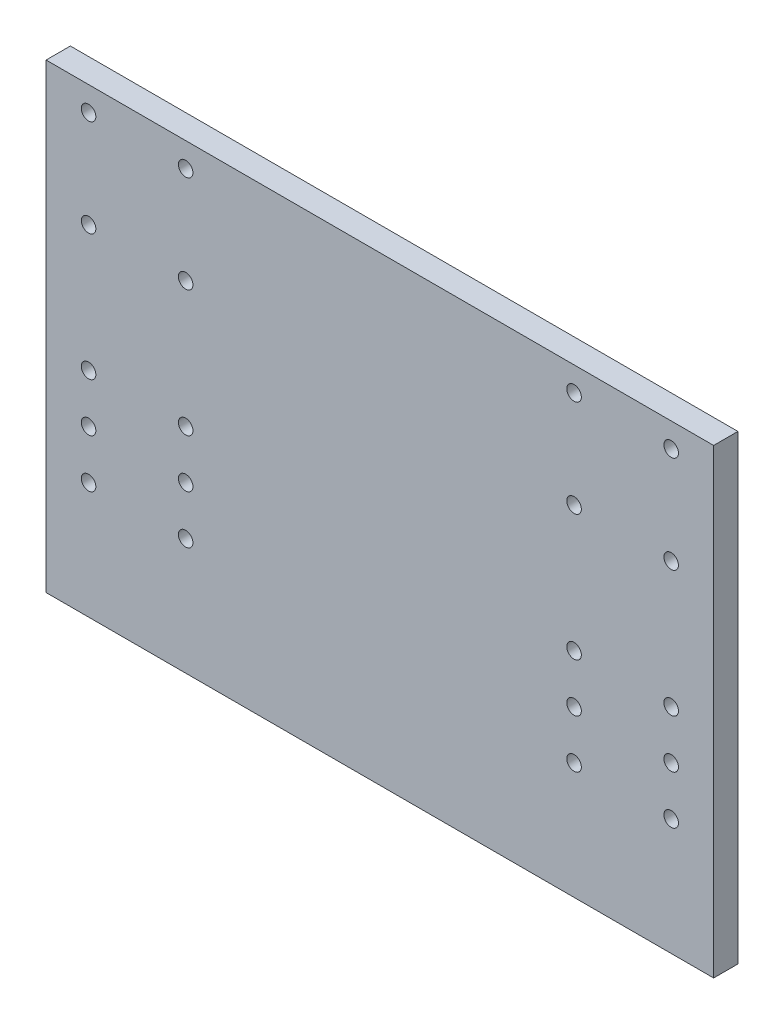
ISO-10303-21;
HEADER;
FILE_DESCRIPTION(('STEP AP214'),'2;1');
FILE_NAME('part.step','',(''),(''),'','','');
FILE_SCHEMA(('AUTOMOTIVE_DESIGN { 1 0 10303 214 1 1 1 1 }'));
ENDSEC;
DATA;
#1=APPLICATION_CONTEXT('core data for automotive mechanical design processes');
#2=APPLICATION_PROTOCOL_DEFINITION('international standard','automotive_design',2000,#1);
#3=PRODUCT_CONTEXT('',#1,'mechanical');
#4=PRODUCT('Part','Part','',(#3));
#5=PRODUCT_RELATED_PRODUCT_CATEGORY('part','',(#4));
#6=PRODUCT_DEFINITION_FORMATION('','',#4);
#7=PRODUCT_DEFINITION_CONTEXT('part definition',#1,'design');
#8=PRODUCT_DEFINITION('design','',#6,#7);
#9=PRODUCT_DEFINITION_SHAPE('','',#8);
#10=(LENGTH_UNIT() NAMED_UNIT(*) SI_UNIT(.MILLI.,.METRE.));
#11=(NAMED_UNIT(*) PLANE_ANGLE_UNIT() SI_UNIT($,.RADIAN.));
#12=(NAMED_UNIT(*) SI_UNIT($,.STERADIAN.) SOLID_ANGLE_UNIT());
#13=UNCERTAINTY_MEASURE_WITH_UNIT(LENGTH_MEASURE(1.E-05),#10,'distance_accuracy_value','');
#14=(GEOMETRIC_REPRESENTATION_CONTEXT(3) GLOBAL_UNCERTAINTY_ASSIGNED_CONTEXT((#13)) GLOBAL_UNIT_ASSIGNED_CONTEXT((#10,
#11,#12)) REPRESENTATION_CONTEXT('',''));
#15=CARTESIAN_POINT('',(0.,0.,0.));
#16=DIRECTION('',(0.,0.,1.));
#17=DIRECTION('',(1.,0.,0.));
#18=AXIS2_PLACEMENT_3D('',#15,#16,#17);
#19=CARTESIAN_POINT('',(-137.5,-95.,10.));
#20=DIRECTION('',(1.,0.,0.));
#21=DIRECTION('',(0.,0.,-1.));
#22=AXIS2_PLACEMENT_3D('',#19,#20,#21);
#23=PLANE('',#22);
#24=DIRECTION('',(0.,-1.,0.));
#25=VECTOR('',#24,1.);
#26=CARTESIAN_POINT('',(-137.5,-95.,0.));
#27=LINE('',#26,#25);
#28=CARTESIAN_POINT('',(-137.5,95.,0.));
#29=VERTEX_POINT('',#28);
#30=CARTESIAN_POINT('',(-137.5,-95.,0.));
#31=VERTEX_POINT('',#30);
#32=EDGE_CURVE('E98',#29,#31,#27,.T.);
#33=ORIENTED_EDGE('',*,*,#32,.T.);
#34=DIRECTION('',(0.,0.,-1.));
#35=VECTOR('',#34,1.);
#36=CARTESIAN_POINT('',(-137.5,-95.,10.));
#37=LINE('',#36,#35);
#38=CARTESIAN_POINT('',(-137.5,-95.,10.));
#39=VERTEX_POINT('',#38);
#40=EDGE_CURVE('E11',#39,#31,#37,.T.);
#41=ORIENTED_EDGE('',*,*,#40,.F.);
#42=DIRECTION('',(0.,-1.,0.));
#43=VECTOR('',#42,1.);
#44=CARTESIAN_POINT('',(-137.5,-95.,10.));
#45=LINE('',#44,#43);
#46=CARTESIAN_POINT('',(-137.5,95.,10.));
#47=VERTEX_POINT('',#46);
#48=EDGE_CURVE('E86',#47,#39,#45,.T.);
#49=ORIENTED_EDGE('',*,*,#48,.F.);
#50=DIRECTION('',(0.,0.,-1.));
#51=VECTOR('',#50,1.);
#52=CARTESIAN_POINT('',(-137.5,95.,10.));
#53=LINE('',#52,#51);
#54=EDGE_CURVE('E94',#47,#29,#53,.T.);
#55=ORIENTED_EDGE('',*,*,#54,.T.);
#56=EDGE_LOOP('',(#33,#41,#49,#55));
#57=FACE_BOUND('',#56,.T.);
#58=ADVANCED_FACE('F35',(#57),#23,.F.);
#59=CARTESIAN_POINT('',(137.5,-95.,10.));
#60=DIRECTION('',(0.,1.,0.));
#61=DIRECTION('',(-1.,0.,0.));
#62=AXIS2_PLACEMENT_3D('',#59,#60,#61);
#63=PLANE('',#62);
#64=DIRECTION('',(1.,0.,0.));
#65=VECTOR('',#64,1.);
#66=CARTESIAN_POINT('',(137.5,-95.,0.));
#67=LINE('',#66,#65);
#68=CARTESIAN_POINT('',(137.5,-95.,0.));
#69=VERTEX_POINT('',#68);
#70=EDGE_CURVE('E90',#31,#69,#67,.T.);
#71=ORIENTED_EDGE('',*,*,#70,.T.);
#72=DIRECTION('',(0.,0.,-1.));
#73=VECTOR('',#72,1.);
#74=CARTESIAN_POINT('',(137.5,-95.,10.));
#75=LINE('',#74,#73);
#76=CARTESIAN_POINT('',(137.5,-95.,10.));
#77=VERTEX_POINT('',#76);
#78=EDGE_CURVE('E43',#77,#69,#75,.T.);
#79=ORIENTED_EDGE('',*,*,#78,.F.);
#80=DIRECTION('',(1.,0.,0.));
#81=VECTOR('',#80,1.);
#82=CARTESIAN_POINT('',(137.5,-95.,10.));
#83=LINE('',#82,#81);
#84=EDGE_CURVE('E81',#39,#77,#83,.T.);
#85=ORIENTED_EDGE('',*,*,#84,.F.);
#86=ORIENTED_EDGE('',*,*,#40,.T.);
#87=EDGE_LOOP('',(#71,#79,#85,#86));
#88=FACE_BOUND('',#87,.T.);
#89=ADVANCED_FACE('F89',(#88),#63,.F.);
#90=CARTESIAN_POINT('',(137.5,-95.,10.));
#91=DIRECTION('',(-1.,0.,0.));
#92=DIRECTION('',(0.,0.,1.));
#93=AXIS2_PLACEMENT_3D('',#90,#91,#92);
#94=PLANE('',#93);
#95=DIRECTION('',(0.,1.,0.));
#96=VECTOR('',#95,1.);
#97=CARTESIAN_POINT('',(137.5,-95.,0.));
#98=LINE('',#97,#96);
#99=CARTESIAN_POINT('',(137.5,95.,0.));
#100=VERTEX_POINT('',#99);
#101=EDGE_CURVE('E68',#69,#100,#98,.T.);
#102=ORIENTED_EDGE('',*,*,#101,.T.);
#103=DIRECTION('',(0.,0.,-1.));
#104=VECTOR('',#103,1.);
#105=CARTESIAN_POINT('',(137.5,95.,10.));
#106=LINE('',#105,#104);
#107=CARTESIAN_POINT('',(137.5,95.,10.));
#108=VERTEX_POINT('',#107);
#109=EDGE_CURVE('E91',#108,#100,#106,.T.);
#110=ORIENTED_EDGE('',*,*,#109,.F.);
#111=DIRECTION('',(0.,1.,0.));
#112=VECTOR('',#111,1.);
#113=CARTESIAN_POINT('',(137.5,-95.,10.));
#114=LINE('',#113,#112);
#115=EDGE_CURVE('E84',#77,#108,#114,.T.);
#116=ORIENTED_EDGE('',*,*,#115,.F.);
#117=ORIENTED_EDGE('',*,*,#78,.T.);
#118=EDGE_LOOP('',(#102,#110,#116,#117));
#119=FACE_BOUND('',#118,.T.);
#120=ADVANCED_FACE('F92',(#119),#94,.F.);
#121=CARTESIAN_POINT('',(137.5,95.,10.));
#122=DIRECTION('',(0.,-1.,0.));
#123=DIRECTION('',(1.,0.,0.));
#124=AXIS2_PLACEMENT_3D('',#121,#122,#123);
#125=PLANE('',#124);
#126=DIRECTION('',(-1.,0.,0.));
#127=VECTOR('',#126,1.);
#128=CARTESIAN_POINT('',(137.5,95.,0.));
#129=LINE('',#128,#127);
#130=EDGE_CURVE('E74',#100,#29,#129,.T.);
#131=ORIENTED_EDGE('',*,*,#130,.T.);
#132=ORIENTED_EDGE('',*,*,#54,.F.);
#133=DIRECTION('',(-1.,0.,0.));
#134=VECTOR('',#133,1.);
#135=CARTESIAN_POINT('',(137.5,95.,10.));
#136=LINE('',#135,#134);
#137=EDGE_CURVE('E51',#108,#47,#136,.T.);
#138=ORIENTED_EDGE('',*,*,#137,.F.);
#139=ORIENTED_EDGE('',*,*,#109,.T.);
#140=EDGE_LOOP('',(#131,#132,#138,#139));
#141=FACE_BOUND('',#140,.T.);
#142=ADVANCED_FACE('F106',(#141),#125,.F.);
#143=CARTESIAN_POINT('',(0.,0.,10.));
#144=DIRECTION('',(0.,0.,1.));
#145=DIRECTION('',(1.,0.,0.));
#146=AXIS2_PLACEMENT_3D('',#143,#144,#145);
#147=PLANE('',#146);
#148=CARTESIAN_POINT('',(80.,45.,10.));
#149=DIRECTION('',(0.,0.,1.));
#150=DIRECTION('',(1.,0.,0.));
#151=AXIS2_PLACEMENT_3D('',#148,#149,#150);
#152=CIRCLE('',#151,3.00000000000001);
#153=CARTESIAN_POINT('',(83.,45.,10.));
#154=VERTEX_POINT('',#153);
#155=EDGE_CURVE('E197',#154,#154,#152,.T.);
#156=ORIENTED_EDGE('',*,*,#155,.F.);
#157=EDGE_LOOP('',(#156));
#158=FACE_BOUND('',#157,.T.);
#159=CARTESIAN_POINT('',(80.,85.,10.));
#160=DIRECTION('',(0.,0.,1.));
#161=DIRECTION('',(1.,0.,0.));
#162=AXIS2_PLACEMENT_3D('',#159,#160,#161);
#163=CIRCLE('',#162,3.00000000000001);
#164=CARTESIAN_POINT('',(83.,85.,10.));
#165=VERTEX_POINT('',#164);
#166=EDGE_CURVE('E191',#165,#165,#163,.T.);
#167=ORIENTED_EDGE('',*,*,#166,.F.);
#168=EDGE_LOOP('',(#167));
#169=FACE_BOUND('',#168,.T.);
#170=CARTESIAN_POINT('',(-80.,85.,10.));
#171=DIRECTION('',(0.,0.,1.));
#172=DIRECTION('',(-1.,0.,0.));
#173=AXIS2_PLACEMENT_3D('',#170,#171,#172);
#174=CIRCLE('',#173,3.00000000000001);
#175=CARTESIAN_POINT('',(-83.,85.,10.));
#176=VERTEX_POINT('',#175);
#177=EDGE_CURVE('E185',#176,#176,#174,.T.);
#178=ORIENTED_EDGE('',*,*,#177,.F.);
#179=EDGE_LOOP('',(#178));
#180=FACE_BOUND('',#179,.T.);
#181=CARTESIAN_POINT('',(-80.,45.,10.));
#182=DIRECTION('',(0.,0.,1.));
#183=DIRECTION('',(-1.,0.,0.));
#184=AXIS2_PLACEMENT_3D('',#181,#182,#183);
#185=CIRCLE('',#184,3.00000000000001);
#186=CARTESIAN_POINT('',(-83.,45.,10.));
#187=VERTEX_POINT('',#186);
#188=EDGE_CURVE('E179',#187,#187,#185,.T.);
#189=ORIENTED_EDGE('',*,*,#188,.F.);
#190=EDGE_LOOP('',(#189));
#191=FACE_BOUND('',#190,.T.);
#192=CARTESIAN_POINT('',(-120.,45.,10.));
#193=DIRECTION('',(0.,0.,1.));
#194=DIRECTION('',(-1.,0.,0.));
#195=AXIS2_PLACEMENT_3D('',#192,#193,#194);
#196=CIRCLE('',#195,3.00000000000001);
#197=CARTESIAN_POINT('',(-123.,45.,10.));
#198=VERTEX_POINT('',#197);
#199=EDGE_CURVE('E172',#198,#198,#196,.T.);
#200=ORIENTED_EDGE('',*,*,#199,.F.);
#201=EDGE_LOOP('',(#200));
#202=FACE_BOUND('',#201,.T.);
#203=CARTESIAN_POINT('',(-120.,85.,10.));
#204=DIRECTION('',(0.,0.,1.));
#205=DIRECTION('',(-1.,0.,0.));
#206=AXIS2_PLACEMENT_3D('',#203,#204,#205);
#207=CIRCLE('',#206,3.00000000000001);
#208=CARTESIAN_POINT('',(-123.,85.,10.));
#209=VERTEX_POINT('',#208);
#210=EDGE_CURVE('E226',#209,#209,#207,.T.);
#211=ORIENTED_EDGE('',*,*,#210,.F.);
#212=EDGE_LOOP('',(#211));
#213=FACE_BOUND('',#212,.T.);
#214=CARTESIAN_POINT('',(-120.,-7.00000000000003,10.));
#215=DIRECTION('',(0.,0.,1.));
#216=DIRECTION('',(1.,0.,0.));
#217=AXIS2_PLACEMENT_3D('',#214,#215,#216);
#218=CIRCLE('',#217,3.00000000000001);
#219=CARTESIAN_POINT('',(-117.,-7.00000000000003,10.));
#220=VERTEX_POINT('',#219);
#221=EDGE_CURVE('E220',#220,#220,#218,.T.);
#222=ORIENTED_EDGE('',*,*,#221,.F.);
#223=EDGE_LOOP('',(#222));
#224=FACE_BOUND('',#223,.T.);
#225=CARTESIAN_POINT('',(-80.,-7.00000000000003,10.));
#226=DIRECTION('',(0.,0.,1.));
#227=DIRECTION('',(1.,0.,0.));
#228=AXIS2_PLACEMENT_3D('',#225,#226,#227);
#229=CIRCLE('',#228,3.00000000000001);
#230=CARTESIAN_POINT('',(-77.,-7.00000000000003,10.));
#231=VERTEX_POINT('',#230);
#232=EDGE_CURVE('E214',#231,#231,#229,.T.);
#233=ORIENTED_EDGE('',*,*,#232,.F.);
#234=EDGE_LOOP('',(#233));
#235=FACE_BOUND('',#234,.T.);
#236=CARTESIAN_POINT('',(80.,-7.00000000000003,10.));
#237=DIRECTION('',(0.,0.,1.));
#238=DIRECTION('',(-1.,0.,0.));
#239=AXIS2_PLACEMENT_3D('',#236,#237,#238);
#240=CIRCLE('',#239,3.00000000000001);
#241=CARTESIAN_POINT('',(77.,-7.00000000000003,10.));
#242=VERTEX_POINT('',#241);
#243=EDGE_CURVE('E208',#242,#242,#240,.T.);
#244=ORIENTED_EDGE('',*,*,#243,.F.);
#245=EDGE_LOOP('',(#244));
#246=FACE_BOUND('',#245,.T.);
#247=CARTESIAN_POINT('',(120.,-7.00000000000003,10.));
#248=DIRECTION('',(0.,0.,1.));
#249=DIRECTION('',(-1.,0.,0.));
#250=AXIS2_PLACEMENT_3D('',#247,#248,#249);
#251=CIRCLE('',#250,3.00000000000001);
#252=CARTESIAN_POINT('',(117.,-7.00000000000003,10.));
#253=VERTEX_POINT('',#252);
#254=EDGE_CURVE('E202',#253,#253,#251,.T.);
#255=ORIENTED_EDGE('',*,*,#254,.F.);
#256=EDGE_LOOP('',(#255));
#257=FACE_BOUND('',#256,.T.);
#258=CARTESIAN_POINT('',(-120.,-27.,10.));
#259=DIRECTION('',(0.,0.,1.));
#260=DIRECTION('',(1.,0.,0.));
#261=AXIS2_PLACEMENT_3D('',#258,#259,#260);
#262=CIRCLE('',#261,3.00000000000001);
#263=CARTESIAN_POINT('',(-117.,-27.,10.));
#264=VERTEX_POINT('',#263);
#265=EDGE_CURVE('E137',#264,#264,#262,.T.);
#266=ORIENTED_EDGE('',*,*,#265,.F.);
#267=EDGE_LOOP('',(#266));
#268=FACE_BOUND('',#267,.T.);
#269=CARTESIAN_POINT('',(-80.,-27.,10.));
#270=DIRECTION('',(0.,0.,1.));
#271=DIRECTION('',(1.,0.,0.));
#272=AXIS2_PLACEMENT_3D('',#269,#270,#271);
#273=CIRCLE('',#272,3.00000000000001);
#274=CARTESIAN_POINT('',(-77.,-27.,10.));
#275=VERTEX_POINT('',#274);
#276=EDGE_CURVE('E131',#275,#275,#273,.T.);
#277=ORIENTED_EDGE('',*,*,#276,.F.);
#278=EDGE_LOOP('',(#277));
#279=FACE_BOUND('',#278,.T.);
#280=CARTESIAN_POINT('',(-80.,-47.,10.));
#281=DIRECTION('',(0.,0.,1.));
#282=DIRECTION('',(1.,0.,0.));
#283=AXIS2_PLACEMENT_3D('',#280,#281,#282);
#284=CIRCLE('',#283,3.00000000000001);
#285=CARTESIAN_POINT('',(-77.,-47.,10.));
#286=VERTEX_POINT('',#285);
#287=EDGE_CURVE('E125',#286,#286,#284,.T.);
#288=ORIENTED_EDGE('',*,*,#287,.F.);
#289=EDGE_LOOP('',(#288));
#290=FACE_BOUND('',#289,.T.);
#291=CARTESIAN_POINT('',(80.,-47.,10.));
#292=DIRECTION('',(0.,0.,1.));
#293=DIRECTION('',(-1.,0.,0.));
#294=AXIS2_PLACEMENT_3D('',#291,#292,#293);
#295=CIRCLE('',#294,3.00000000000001);
#296=CARTESIAN_POINT('',(77.,-47.,10.));
#297=VERTEX_POINT('',#296);
#298=EDGE_CURVE('E118',#297,#297,#295,.T.);
#299=ORIENTED_EDGE('',*,*,#298,.F.);
#300=EDGE_LOOP('',(#299));
#301=FACE_BOUND('',#300,.T.);
#302=CARTESIAN_POINT('',(120.,45.,10.));
#303=DIRECTION('',(0.,0.,1.));
#304=DIRECTION('',(1.,0.,0.));
#305=AXIS2_PLACEMENT_3D('',#302,#303,#304);
#306=CIRCLE('',#305,3.00000000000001);
#307=CARTESIAN_POINT('',(123.,45.,10.));
#308=VERTEX_POINT('',#307);
#309=EDGE_CURVE('E154',#308,#308,#306,.T.);
#310=ORIENTED_EDGE('',*,*,#309,.F.);
#311=EDGE_LOOP('',(#310));
#312=FACE_BOUND('',#311,.T.);
#313=CARTESIAN_POINT('',(120.,85.,10.));
#314=DIRECTION('',(0.,0.,1.));
#315=DIRECTION('',(1.,0.,0.));
#316=AXIS2_PLACEMENT_3D('',#313,#314,#315);
#317=CIRCLE('',#316,3.00000000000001);
#318=CARTESIAN_POINT('',(123.,85.,10.));
#319=VERTEX_POINT('',#318);
#320=EDGE_CURVE('E161',#319,#319,#317,.T.);
#321=ORIENTED_EDGE('',*,*,#320,.F.);
#322=EDGE_LOOP('',(#321));
#323=FACE_BOUND('',#322,.T.);
#324=CARTESIAN_POINT('',(120.,-47.,10.));
#325=DIRECTION('',(0.,0.,1.));
#326=DIRECTION('',(-1.,0.,0.));
#327=AXIS2_PLACEMENT_3D('',#324,#325,#326);
#328=CIRCLE('',#327,3.00000000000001);
#329=CARTESIAN_POINT('',(117.,-47.,10.));
#330=VERTEX_POINT('',#329);
#331=EDGE_CURVE('E167',#330,#330,#328,.T.);
#332=ORIENTED_EDGE('',*,*,#331,.F.);
#333=EDGE_LOOP('',(#332));
#334=FACE_BOUND('',#333,.T.);
#335=CARTESIAN_POINT('',(120.,-27.,10.));
#336=DIRECTION('',(0.,0.,1.));
#337=DIRECTION('',(-1.,0.,0.));
#338=AXIS2_PLACEMENT_3D('',#335,#336,#337);
#339=CIRCLE('',#338,3.00000000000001);
#340=CARTESIAN_POINT('',(117.,-27.,10.));
#341=VERTEX_POINT('',#340);
#342=EDGE_CURVE('E142',#341,#341,#339,.T.);
#343=ORIENTED_EDGE('',*,*,#342,.F.);
#344=EDGE_LOOP('',(#343));
#345=FACE_BOUND('',#344,.T.);
#346=CARTESIAN_POINT('',(80.,-27.,10.));
#347=DIRECTION('',(0.,0.,1.));
#348=DIRECTION('',(-1.,0.,0.));
#349=AXIS2_PLACEMENT_3D('',#346,#347,#348);
#350=CIRCLE('',#349,3.00000000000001);
#351=CARTESIAN_POINT('',(77.,-27.,10.));
#352=VERTEX_POINT('',#351);
#353=EDGE_CURVE('E149',#352,#352,#350,.T.);
#354=ORIENTED_EDGE('',*,*,#353,.F.);
#355=EDGE_LOOP('',(#354));
#356=FACE_BOUND('',#355,.T.);
#357=CARTESIAN_POINT('',(-120.,-47.,10.));
#358=DIRECTION('',(0.,0.,1.));
#359=DIRECTION('',(1.,0.,0.));
#360=AXIS2_PLACEMENT_3D('',#357,#358,#359);
#361=CIRCLE('',#360,3.00000000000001);
#362=CARTESIAN_POINT('',(-117.,-47.,10.));
#363=VERTEX_POINT('',#362);
#364=EDGE_CURVE('E112',#363,#363,#361,.T.);
#365=ORIENTED_EDGE('',*,*,#364,.F.);
#366=EDGE_LOOP('',(#365));
#367=FACE_BOUND('',#366,.T.);
#368=ORIENTED_EDGE('',*,*,#48,.T.);
#369=ORIENTED_EDGE('',*,*,#84,.T.);
#370=ORIENTED_EDGE('',*,*,#115,.T.);
#371=ORIENTED_EDGE('',*,*,#137,.T.);
#372=EDGE_LOOP('',(#368,#369,#370,#371));
#373=FACE_BOUND('',#372,.T.);
#374=ADVANCED_FACE('F82',(#158,#169,#180,#191,#202,#213,#224,#235,#246,#257,#268,#279,#290,#301,
#312,#323,#334,#345,#356,#367,#373),#147,.T.);
#375=CARTESIAN_POINT('',(0.,0.,0.));
#376=DIRECTION('',(0.,0.,1.));
#377=DIRECTION('',(1.,0.,0.));
#378=AXIS2_PLACEMENT_3D('',#375,#376,#377);
#379=PLANE('',#378);
#380=CARTESIAN_POINT('',(80.,45.,0.));
#381=DIRECTION('',(0.,0.,1.));
#382=DIRECTION('',(1.,0.,0.));
#383=AXIS2_PLACEMENT_3D('',#380,#381,#382);
#384=CIRCLE('',#383,3.00000000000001);
#385=CARTESIAN_POINT('',(83.,45.,0.));
#386=VERTEX_POINT('',#385);
#387=EDGE_CURVE('E158',#386,#386,#384,.T.);
#388=ORIENTED_EDGE('',*,*,#387,.T.);
#389=EDGE_LOOP('',(#388));
#390=FACE_BOUND('',#389,.T.);
#391=CARTESIAN_POINT('',(80.,85.,0.));
#392=DIRECTION('',(0.,0.,1.));
#393=DIRECTION('',(1.,0.,0.));
#394=AXIS2_PLACEMENT_3D('',#391,#392,#393);
#395=CIRCLE('',#394,3.00000000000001);
#396=CARTESIAN_POINT('',(83.,85.,0.));
#397=VERTEX_POINT('',#396);
#398=EDGE_CURVE('E194',#397,#397,#395,.T.);
#399=ORIENTED_EDGE('',*,*,#398,.T.);
#400=EDGE_LOOP('',(#399));
#401=FACE_BOUND('',#400,.T.);
#402=CARTESIAN_POINT('',(-80.,85.,0.));
#403=DIRECTION('',(0.,0.,1.));
#404=DIRECTION('',(-1.,0.,0.));
#405=AXIS2_PLACEMENT_3D('',#402,#403,#404);
#406=CIRCLE('',#405,3.00000000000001);
#407=CARTESIAN_POINT('',(-83.,85.,0.));
#408=VERTEX_POINT('',#407);
#409=EDGE_CURVE('E188',#408,#408,#406,.T.);
#410=ORIENTED_EDGE('',*,*,#409,.T.);
#411=EDGE_LOOP('',(#410));
#412=FACE_BOUND('',#411,.T.);
#413=CARTESIAN_POINT('',(-80.,45.,0.));
#414=DIRECTION('',(0.,0.,1.));
#415=DIRECTION('',(-1.,0.,0.));
#416=AXIS2_PLACEMENT_3D('',#413,#414,#415);
#417=CIRCLE('',#416,3.00000000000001);
#418=CARTESIAN_POINT('',(-83.,45.,0.));
#419=VERTEX_POINT('',#418);
#420=EDGE_CURVE('E182',#419,#419,#417,.T.);
#421=ORIENTED_EDGE('',*,*,#420,.T.);
#422=EDGE_LOOP('',(#421));
#423=FACE_BOUND('',#422,.T.);
#424=CARTESIAN_POINT('',(-120.,45.,0.));
#425=DIRECTION('',(0.,0.,1.));
#426=DIRECTION('',(-1.,0.,0.));
#427=AXIS2_PLACEMENT_3D('',#424,#425,#426);
#428=CIRCLE('',#427,3.00000000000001);
#429=CARTESIAN_POINT('',(-123.,45.,0.));
#430=VERTEX_POINT('',#429);
#431=EDGE_CURVE('E175',#430,#430,#428,.T.);
#432=ORIENTED_EDGE('',*,*,#431,.T.);
#433=EDGE_LOOP('',(#432));
#434=FACE_BOUND('',#433,.T.);
#435=CARTESIAN_POINT('',(-120.,85.,0.));
#436=DIRECTION('',(0.,0.,1.));
#437=DIRECTION('',(-1.,0.,0.));
#438=AXIS2_PLACEMENT_3D('',#435,#436,#437);
#439=CIRCLE('',#438,3.00000000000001);
#440=CARTESIAN_POINT('',(-123.,85.,0.));
#441=VERTEX_POINT('',#440);
#442=EDGE_CURVE('E176',#441,#441,#439,.T.);
#443=ORIENTED_EDGE('',*,*,#442,.T.);
#444=EDGE_LOOP('',(#443));
#445=FACE_BOUND('',#444,.T.);
#446=CARTESIAN_POINT('',(-120.,-7.00000000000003,0.));
#447=DIRECTION('',(0.,0.,1.));
#448=DIRECTION('',(1.,0.,0.));
#449=AXIS2_PLACEMENT_3D('',#446,#447,#448);
#450=CIRCLE('',#449,3.00000000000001);
#451=CARTESIAN_POINT('',(-117.,-7.00000000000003,0.));
#452=VERTEX_POINT('',#451);
#453=EDGE_CURVE('E223',#452,#452,#450,.T.);
#454=ORIENTED_EDGE('',*,*,#453,.T.);
#455=EDGE_LOOP('',(#454));
#456=FACE_BOUND('',#455,.T.);
#457=CARTESIAN_POINT('',(-80.,-7.00000000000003,0.));
#458=DIRECTION('',(0.,0.,1.));
#459=DIRECTION('',(1.,0.,0.));
#460=AXIS2_PLACEMENT_3D('',#457,#458,#459);
#461=CIRCLE('',#460,3.00000000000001);
#462=CARTESIAN_POINT('',(-77.,-7.00000000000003,0.));
#463=VERTEX_POINT('',#462);
#464=EDGE_CURVE('E217',#463,#463,#461,.T.);
#465=ORIENTED_EDGE('',*,*,#464,.T.);
#466=EDGE_LOOP('',(#465));
#467=FACE_BOUND('',#466,.T.);
#468=CARTESIAN_POINT('',(80.,-7.00000000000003,0.));
#469=DIRECTION('',(0.,0.,1.));
#470=DIRECTION('',(-1.,0.,0.));
#471=AXIS2_PLACEMENT_3D('',#468,#469,#470);
#472=CIRCLE('',#471,3.00000000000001);
#473=CARTESIAN_POINT('',(77.,-7.00000000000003,0.));
#474=VERTEX_POINT('',#473);
#475=EDGE_CURVE('E211',#474,#474,#472,.T.);
#476=ORIENTED_EDGE('',*,*,#475,.T.);
#477=EDGE_LOOP('',(#476));
#478=FACE_BOUND('',#477,.T.);
#479=CARTESIAN_POINT('',(120.,-7.00000000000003,0.));
#480=DIRECTION('',(0.,0.,1.));
#481=DIRECTION('',(-1.,0.,0.));
#482=AXIS2_PLACEMENT_3D('',#479,#480,#481);
#483=CIRCLE('',#482,3.00000000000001);
#484=CARTESIAN_POINT('',(117.,-7.00000000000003,0.));
#485=VERTEX_POINT('',#484);
#486=EDGE_CURVE('E205',#485,#485,#483,.T.);
#487=ORIENTED_EDGE('',*,*,#486,.T.);
#488=EDGE_LOOP('',(#487));
#489=FACE_BOUND('',#488,.T.);
#490=CARTESIAN_POINT('',(-120.,-27.,0.));
#491=DIRECTION('',(0.,0.,1.));
#492=DIRECTION('',(1.,0.,0.));
#493=AXIS2_PLACEMENT_3D('',#490,#491,#492);
#494=CIRCLE('',#493,3.00000000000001);
#495=CARTESIAN_POINT('',(-117.,-27.,0.));
#496=VERTEX_POINT('',#495);
#497=EDGE_CURVE('E115',#496,#496,#494,.T.);
#498=ORIENTED_EDGE('',*,*,#497,.T.);
#499=EDGE_LOOP('',(#498));
#500=FACE_BOUND('',#499,.T.);
#501=CARTESIAN_POINT('',(-80.,-27.,0.));
#502=DIRECTION('',(0.,0.,1.));
#503=DIRECTION('',(1.,0.,0.));
#504=AXIS2_PLACEMENT_3D('',#501,#502,#503);
#505=CIRCLE('',#504,3.00000000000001);
#506=CARTESIAN_POINT('',(-77.,-27.,0.));
#507=VERTEX_POINT('',#506);
#508=EDGE_CURVE('E134',#507,#507,#505,.T.);
#509=ORIENTED_EDGE('',*,*,#508,.T.);
#510=EDGE_LOOP('',(#509));
#511=FACE_BOUND('',#510,.T.);
#512=CARTESIAN_POINT('',(-80.,-47.,0.));
#513=DIRECTION('',(0.,0.,1.));
#514=DIRECTION('',(1.,0.,0.));
#515=AXIS2_PLACEMENT_3D('',#512,#513,#514);
#516=CIRCLE('',#515,3.00000000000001);
#517=CARTESIAN_POINT('',(-77.,-47.,0.));
#518=VERTEX_POINT('',#517);
#519=EDGE_CURVE('E128',#518,#518,#516,.T.);
#520=ORIENTED_EDGE('',*,*,#519,.T.);
#521=EDGE_LOOP('',(#520));
#522=FACE_BOUND('',#521,.T.);
#523=CARTESIAN_POINT('',(80.,-47.,0.));
#524=DIRECTION('',(0.,0.,1.));
#525=DIRECTION('',(-1.,0.,0.));
#526=AXIS2_PLACEMENT_3D('',#523,#524,#525);
#527=CIRCLE('',#526,3.00000000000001);
#528=CARTESIAN_POINT('',(77.,-47.,0.));
#529=VERTEX_POINT('',#528);
#530=EDGE_CURVE('E121',#529,#529,#527,.T.);
#531=ORIENTED_EDGE('',*,*,#530,.T.);
#532=EDGE_LOOP('',(#531));
#533=FACE_BOUND('',#532,.T.);
#534=CARTESIAN_POINT('',(120.,45.,0.));
#535=DIRECTION('',(0.,0.,1.));
#536=DIRECTION('',(1.,0.,0.));
#537=AXIS2_PLACEMENT_3D('',#534,#535,#536);
#538=CIRCLE('',#537,3.00000000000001);
#539=CARTESIAN_POINT('',(123.,45.,0.));
#540=VERTEX_POINT('',#539);
#541=EDGE_CURVE('E157',#540,#540,#538,.T.);
#542=ORIENTED_EDGE('',*,*,#541,.T.);
#543=EDGE_LOOP('',(#542));
#544=FACE_BOUND('',#543,.T.);
#545=CARTESIAN_POINT('',(120.,85.,0.));
#546=DIRECTION('',(0.,0.,1.));
#547=DIRECTION('',(1.,0.,0.));
#548=AXIS2_PLACEMENT_3D('',#545,#546,#547);
#549=CIRCLE('',#548,3.00000000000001);
#550=CARTESIAN_POINT('',(123.,85.,0.));
#551=VERTEX_POINT('',#550);
#552=EDGE_CURVE('E164',#551,#551,#549,.T.);
#553=ORIENTED_EDGE('',*,*,#552,.T.);
#554=EDGE_LOOP('',(#553));
#555=FACE_BOUND('',#554,.T.);
#556=CARTESIAN_POINT('',(120.,-47.,0.));
#557=DIRECTION('',(0.,0.,1.));
#558=DIRECTION('',(-1.,0.,0.));
#559=AXIS2_PLACEMENT_3D('',#556,#557,#558);
#560=CIRCLE('',#559,3.00000000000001);
#561=CARTESIAN_POINT('',(117.,-47.,0.));
#562=VERTEX_POINT('',#561);
#563=EDGE_CURVE('E146',#562,#562,#560,.T.);
#564=ORIENTED_EDGE('',*,*,#563,.T.);
#565=EDGE_LOOP('',(#564));
#566=FACE_BOUND('',#565,.T.);
#567=CARTESIAN_POINT('',(120.,-27.,0.));
#568=DIRECTION('',(0.,0.,1.));
#569=DIRECTION('',(-1.,0.,0.));
#570=AXIS2_PLACEMENT_3D('',#567,#568,#569);
#571=CIRCLE('',#570,3.00000000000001);
#572=CARTESIAN_POINT('',(117.,-27.,0.));
#573=VERTEX_POINT('',#572);
#574=EDGE_CURVE('E145',#573,#573,#571,.T.);
#575=ORIENTED_EDGE('',*,*,#574,.T.);
#576=EDGE_LOOP('',(#575));
#577=FACE_BOUND('',#576,.T.);
#578=CARTESIAN_POINT('',(80.,-27.,0.));
#579=DIRECTION('',(0.,0.,1.));
#580=DIRECTION('',(-1.,0.,0.));
#581=AXIS2_PLACEMENT_3D('',#578,#579,#580);
#582=CIRCLE('',#581,3.00000000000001);
#583=CARTESIAN_POINT('',(77.,-27.,0.));
#584=VERTEX_POINT('',#583);
#585=EDGE_CURVE('E122',#584,#584,#582,.T.);
#586=ORIENTED_EDGE('',*,*,#585,.T.);
#587=EDGE_LOOP('',(#586));
#588=FACE_BOUND('',#587,.T.);
#589=CARTESIAN_POINT('',(-120.,-47.,0.));
#590=DIRECTION('',(0.,0.,1.));
#591=DIRECTION('',(1.,0.,0.));
#592=AXIS2_PLACEMENT_3D('',#589,#590,#591);
#593=CIRCLE('',#592,3.00000000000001);
#594=CARTESIAN_POINT('',(-117.,-47.,0.));
#595=VERTEX_POINT('',#594);
#596=EDGE_CURVE('E101',#595,#595,#593,.T.);
#597=ORIENTED_EDGE('',*,*,#596,.T.);
#598=EDGE_LOOP('',(#597));
#599=FACE_BOUND('',#598,.T.);
#600=ORIENTED_EDGE('',*,*,#32,.F.);
#601=ORIENTED_EDGE('',*,*,#130,.F.);
#602=ORIENTED_EDGE('',*,*,#101,.F.);
#603=ORIENTED_EDGE('',*,*,#70,.F.);
#604=EDGE_LOOP('',(#600,#601,#602,#603));
#605=FACE_BOUND('',#604,.T.);
#606=ADVANCED_FACE('F109',(#390,#401,#412,#423,#434,#445,#456,#467,#478,#489,#500,#511,#522,
#533,#544,#555,#566,#577,#588,#599,#605),#379,.F.);
#607=CARTESIAN_POINT('',(-120.,-47.,0.));
#608=DIRECTION('',(0.,0.,1.));
#609=DIRECTION('',(1.,0.,0.));
#610=AXIS2_PLACEMENT_3D('',#607,#608,#609);
#611=CYLINDRICAL_SURFACE('',#610,3.00000000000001);
#612=ORIENTED_EDGE('',*,*,#596,.F.);
#613=EDGE_LOOP('',(#612));
#614=FACE_BOUND('',#613,.T.);
#615=ORIENTED_EDGE('',*,*,#364,.T.);
#616=EDGE_LOOP('',(#615));
#617=FACE_BOUND('',#616,.T.);
#618=ADVANCED_FACE('F274',(#614,#617),#611,.F.);
#619=CARTESIAN_POINT('',(80.,-27.,0.));
#620=DIRECTION('',(0.,0.,1.));
#621=DIRECTION('',(1.,0.,0.));
#622=AXIS2_PLACEMENT_3D('',#619,#620,#621);
#623=CYLINDRICAL_SURFACE('',#622,3.00000000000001);
#624=ORIENTED_EDGE('',*,*,#585,.F.);
#625=EDGE_LOOP('',(#624));
#626=FACE_BOUND('',#625,.T.);
#627=ORIENTED_EDGE('',*,*,#353,.T.);
#628=EDGE_LOOP('',(#627));
#629=FACE_BOUND('',#628,.T.);
#630=ADVANCED_FACE('F276',(#626,#629),#623,.F.);
#631=CARTESIAN_POINT('',(120.,-27.,0.));
#632=DIRECTION('',(0.,0.,1.));
#633=DIRECTION('',(1.,0.,0.));
#634=AXIS2_PLACEMENT_3D('',#631,#632,#633);
#635=CYLINDRICAL_SURFACE('',#634,3.00000000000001);
#636=ORIENTED_EDGE('',*,*,#574,.F.);
#637=EDGE_LOOP('',(#636));
#638=FACE_BOUND('',#637,.T.);
#639=ORIENTED_EDGE('',*,*,#342,.T.);
#640=EDGE_LOOP('',(#639));
#641=FACE_BOUND('',#640,.T.);
#642=ADVANCED_FACE('F283',(#638,#641),#635,.F.);
#643=CARTESIAN_POINT('',(120.,-47.,0.));
#644=DIRECTION('',(0.,0.,1.));
#645=DIRECTION('',(1.,0.,0.));
#646=AXIS2_PLACEMENT_3D('',#643,#644,#645);
#647=CYLINDRICAL_SURFACE('',#646,3.00000000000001);
#648=ORIENTED_EDGE('',*,*,#563,.F.);
#649=EDGE_LOOP('',(#648));
#650=FACE_BOUND('',#649,.T.);
#651=ORIENTED_EDGE('',*,*,#331,.T.);
#652=EDGE_LOOP('',(#651));
#653=FACE_BOUND('',#652,.T.);
#654=ADVANCED_FACE('F331',(#650,#653),#647,.F.);
#655=CARTESIAN_POINT('',(120.,85.,0.));
#656=DIRECTION('',(0.,0.,1.));
#657=DIRECTION('',(1.,0.,0.));
#658=AXIS2_PLACEMENT_3D('',#655,#656,#657);
#659=CYLINDRICAL_SURFACE('',#658,3.00000000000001);
#660=ORIENTED_EDGE('',*,*,#552,.F.);
#661=EDGE_LOOP('',(#660));
#662=FACE_BOUND('',#661,.T.);
#663=ORIENTED_EDGE('',*,*,#320,.T.);
#664=EDGE_LOOP('',(#663));
#665=FACE_BOUND('',#664,.T.);
#666=ADVANCED_FACE('F341',(#662,#665),#659,.F.);
#667=CARTESIAN_POINT('',(120.,45.,0.));
#668=DIRECTION('',(0.,0.,1.));
#669=DIRECTION('',(1.,0.,0.));
#670=AXIS2_PLACEMENT_3D('',#667,#668,#669);
#671=CYLINDRICAL_SURFACE('',#670,3.00000000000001);
#672=ORIENTED_EDGE('',*,*,#541,.F.);
#673=EDGE_LOOP('',(#672));
#674=FACE_BOUND('',#673,.T.);
#675=ORIENTED_EDGE('',*,*,#309,.T.);
#676=EDGE_LOOP('',(#675));
#677=FACE_BOUND('',#676,.T.);
#678=ADVANCED_FACE('F351',(#674,#677),#671,.F.);
#679=CARTESIAN_POINT('',(80.,-47.,0.));
#680=DIRECTION('',(0.,0.,1.));
#681=DIRECTION('',(1.,0.,0.));
#682=AXIS2_PLACEMENT_3D('',#679,#680,#681);
#683=CYLINDRICAL_SURFACE('',#682,3.00000000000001);
#684=ORIENTED_EDGE('',*,*,#530,.F.);
#685=EDGE_LOOP('',(#684));
#686=FACE_BOUND('',#685,.T.);
#687=ORIENTED_EDGE('',*,*,#298,.T.);
#688=EDGE_LOOP('',(#687));
#689=FACE_BOUND('',#688,.T.);
#690=ADVANCED_FACE('F361',(#686,#689),#683,.F.);
#691=CARTESIAN_POINT('',(-80.,-47.,0.));
#692=DIRECTION('',(0.,0.,1.));
#693=DIRECTION('',(1.,0.,0.));
#694=AXIS2_PLACEMENT_3D('',#691,#692,#693);
#695=CYLINDRICAL_SURFACE('',#694,3.00000000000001);
#696=ORIENTED_EDGE('',*,*,#519,.F.);
#697=EDGE_LOOP('',(#696));
#698=FACE_BOUND('',#697,.T.);
#699=ORIENTED_EDGE('',*,*,#287,.T.);
#700=EDGE_LOOP('',(#699));
#701=FACE_BOUND('',#700,.T.);
#702=ADVANCED_FACE('F371',(#698,#701),#695,.F.);
#703=CARTESIAN_POINT('',(-80.,-27.,0.));
#704=DIRECTION('',(0.,0.,1.));
#705=DIRECTION('',(1.,0.,0.));
#706=AXIS2_PLACEMENT_3D('',#703,#704,#705);
#707=CYLINDRICAL_SURFACE('',#706,3.00000000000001);
#708=ORIENTED_EDGE('',*,*,#508,.F.);
#709=EDGE_LOOP('',(#708));
#710=FACE_BOUND('',#709,.T.);
#711=ORIENTED_EDGE('',*,*,#276,.T.);
#712=EDGE_LOOP('',(#711));
#713=FACE_BOUND('',#712,.T.);
#714=ADVANCED_FACE('F380',(#710,#713),#707,.F.);
#715=CARTESIAN_POINT('',(-120.,-27.,0.));
#716=DIRECTION('',(0.,0.,1.));
#717=DIRECTION('',(1.,0.,0.));
#718=AXIS2_PLACEMENT_3D('',#715,#716,#717);
#719=CYLINDRICAL_SURFACE('',#718,3.00000000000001);
#720=ORIENTED_EDGE('',*,*,#497,.F.);
#721=EDGE_LOOP('',(#720));
#722=FACE_BOUND('',#721,.T.);
#723=ORIENTED_EDGE('',*,*,#265,.T.);
#724=EDGE_LOOP('',(#723));
#725=FACE_BOUND('',#724,.T.);
#726=ADVANCED_FACE('F390',(#722,#725),#719,.F.);
#727=CARTESIAN_POINT('',(120.,-7.00000000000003,0.));
#728=DIRECTION('',(0.,0.,1.));
#729=DIRECTION('',(1.,0.,0.));
#730=AXIS2_PLACEMENT_3D('',#727,#728,#729);
#731=CYLINDRICAL_SURFACE('',#730,3.00000000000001);
#732=ORIENTED_EDGE('',*,*,#486,.F.);
#733=EDGE_LOOP('',(#732));
#734=FACE_BOUND('',#733,.T.);
#735=ORIENTED_EDGE('',*,*,#254,.T.);
#736=EDGE_LOOP('',(#735));
#737=FACE_BOUND('',#736,.T.);
#738=ADVANCED_FACE('F400',(#734,#737),#731,.F.);
#739=CARTESIAN_POINT('',(80.,-7.00000000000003,0.));
#740=DIRECTION('',(0.,0.,1.));
#741=DIRECTION('',(1.,0.,0.));
#742=AXIS2_PLACEMENT_3D('',#739,#740,#741);
#743=CYLINDRICAL_SURFACE('',#742,3.00000000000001);
#744=ORIENTED_EDGE('',*,*,#475,.F.);
#745=EDGE_LOOP('',(#744));
#746=FACE_BOUND('',#745,.T.);
#747=ORIENTED_EDGE('',*,*,#243,.T.);
#748=EDGE_LOOP('',(#747));
#749=FACE_BOUND('',#748,.T.);
#750=ADVANCED_FACE('F410',(#746,#749),#743,.F.);
#751=CARTESIAN_POINT('',(-80.,-7.00000000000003,0.));
#752=DIRECTION('',(0.,0.,1.));
#753=DIRECTION('',(1.,0.,0.));
#754=AXIS2_PLACEMENT_3D('',#751,#752,#753);
#755=CYLINDRICAL_SURFACE('',#754,3.00000000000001);
#756=ORIENTED_EDGE('',*,*,#464,.F.);
#757=EDGE_LOOP('',(#756));
#758=FACE_BOUND('',#757,.T.);
#759=ORIENTED_EDGE('',*,*,#232,.T.);
#760=EDGE_LOOP('',(#759));
#761=FACE_BOUND('',#760,.T.);
#762=ADVANCED_FACE('F420',(#758,#761),#755,.F.);
#763=CARTESIAN_POINT('',(-120.,-7.00000000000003,0.));
#764=DIRECTION('',(0.,0.,1.));
#765=DIRECTION('',(1.,0.,0.));
#766=AXIS2_PLACEMENT_3D('',#763,#764,#765);
#767=CYLINDRICAL_SURFACE('',#766,3.00000000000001);
#768=ORIENTED_EDGE('',*,*,#453,.F.);
#769=EDGE_LOOP('',(#768));
#770=FACE_BOUND('',#769,.T.);
#771=ORIENTED_EDGE('',*,*,#221,.T.);
#772=EDGE_LOOP('',(#771));
#773=FACE_BOUND('',#772,.T.);
#774=ADVANCED_FACE('F238',(#770,#773),#767,.F.);
#775=CARTESIAN_POINT('',(-120.,85.,0.));
#776=DIRECTION('',(0.,0.,1.));
#777=DIRECTION('',(1.,0.,0.));
#778=AXIS2_PLACEMENT_3D('',#775,#776,#777);
#779=CYLINDRICAL_SURFACE('',#778,3.00000000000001);
#780=ORIENTED_EDGE('',*,*,#442,.F.);
#781=EDGE_LOOP('',(#780));
#782=FACE_BOUND('',#781,.T.);
#783=ORIENTED_EDGE('',*,*,#210,.T.);
#784=EDGE_LOOP('',(#783));
#785=FACE_BOUND('',#784,.T.);
#786=ADVANCED_FACE('F234',(#782,#785),#779,.F.);
#787=CARTESIAN_POINT('',(-120.,45.,0.));
#788=DIRECTION('',(0.,0.,1.));
#789=DIRECTION('',(1.,0.,0.));
#790=AXIS2_PLACEMENT_3D('',#787,#788,#789);
#791=CYLINDRICAL_SURFACE('',#790,3.00000000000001);
#792=ORIENTED_EDGE('',*,*,#431,.F.);
#793=EDGE_LOOP('',(#792));
#794=FACE_BOUND('',#793,.T.);
#795=ORIENTED_EDGE('',*,*,#199,.T.);
#796=EDGE_LOOP('',(#795));
#797=FACE_BOUND('',#796,.T.);
#798=ADVANCED_FACE('F237',(#794,#797),#791,.F.);
#799=CARTESIAN_POINT('',(-80.,45.,0.));
#800=DIRECTION('',(0.,0.,1.));
#801=DIRECTION('',(1.,0.,0.));
#802=AXIS2_PLACEMENT_3D('',#799,#800,#801);
#803=CYLINDRICAL_SURFACE('',#802,3.00000000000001);
#804=ORIENTED_EDGE('',*,*,#420,.F.);
#805=EDGE_LOOP('',(#804));
#806=FACE_BOUND('',#805,.T.);
#807=ORIENTED_EDGE('',*,*,#188,.T.);
#808=EDGE_LOOP('',(#807));
#809=FACE_BOUND('',#808,.T.);
#810=ADVANCED_FACE('F454',(#806,#809),#803,.F.);
#811=CARTESIAN_POINT('',(-80.,85.,0.));
#812=DIRECTION('',(0.,0.,1.));
#813=DIRECTION('',(1.,0.,0.));
#814=AXIS2_PLACEMENT_3D('',#811,#812,#813);
#815=CYLINDRICAL_SURFACE('',#814,3.00000000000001);
#816=ORIENTED_EDGE('',*,*,#409,.F.);
#817=EDGE_LOOP('',(#816));
#818=FACE_BOUND('',#817,.T.);
#819=ORIENTED_EDGE('',*,*,#177,.T.);
#820=EDGE_LOOP('',(#819));
#821=FACE_BOUND('',#820,.T.);
#822=ADVANCED_FACE('F464',(#818,#821),#815,.F.);
#823=CARTESIAN_POINT('',(80.,85.,0.));
#824=DIRECTION('',(0.,0.,1.));
#825=DIRECTION('',(1.,0.,0.));
#826=AXIS2_PLACEMENT_3D('',#823,#824,#825);
#827=CYLINDRICAL_SURFACE('',#826,3.00000000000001);
#828=ORIENTED_EDGE('',*,*,#398,.F.);
#829=EDGE_LOOP('',(#828));
#830=FACE_BOUND('',#829,.T.);
#831=ORIENTED_EDGE('',*,*,#166,.T.);
#832=EDGE_LOOP('',(#831));
#833=FACE_BOUND('',#832,.T.);
#834=ADVANCED_FACE('F474',(#830,#833),#827,.F.);
#835=CARTESIAN_POINT('',(80.,45.,0.));
#836=DIRECTION('',(0.,0.,1.));
#837=DIRECTION('',(1.,0.,0.));
#838=AXIS2_PLACEMENT_3D('',#835,#836,#837);
#839=CYLINDRICAL_SURFACE('',#838,3.00000000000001);
#840=ORIENTED_EDGE('',*,*,#387,.F.);
#841=EDGE_LOOP('',(#840));
#842=FACE_BOUND('',#841,.T.);
#843=ORIENTED_EDGE('',*,*,#155,.T.);
#844=EDGE_LOOP('',(#843));
#845=FACE_BOUND('',#844,.T.);
#846=ADVANCED_FACE('F484',(#842,#845),#839,.F.);
#847=CLOSED_SHELL('',(#58,#89,#120,#142,#374,#606,#618,#630,#642,#654,#666,#678,#690,#702,#714,
#726,#738,#750,#762,#774,#786,#798,#810,#822,#834,#846));
#848=MANIFOLD_SOLID_BREP('B2',#847);
#849=ADVANCED_BREP_SHAPE_REPRESENTATION('',(#18,#848),#14);
#850=SHAPE_DEFINITION_REPRESENTATION(#9,#849);
ENDSEC;
END-ISO-10303-21;
